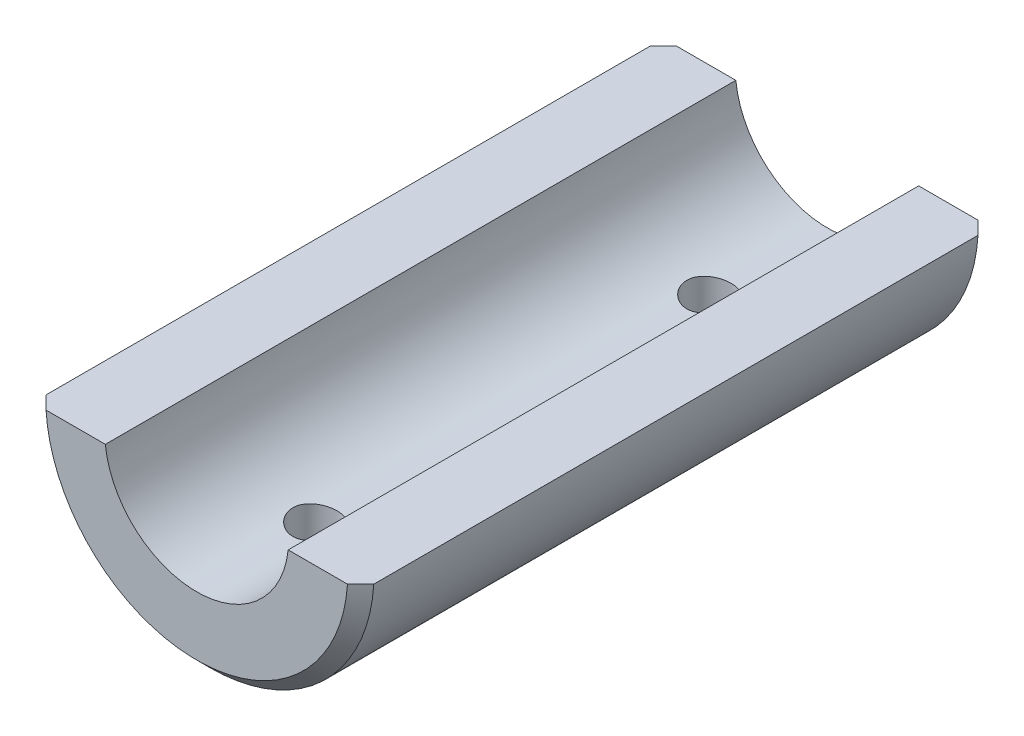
from build123d import *

# Parameters (mm, degrees)
EXTRUSION1_DEPTH        = 96
ESQUISSE5_R             = 3.375
ENL_V_MAT_EXTRU_1_DEPTH = 102.936254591
CHANFREIN1_SIZE         = 2


with BuildPart() as part:
    # Esquisse1 → Extrusion1 (new body)
    with BuildSketch(Plane.XY):
        with BuildLine():
            Line((-24.954959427, -1.5), (-13.919410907, -1.5))
            ThreePointArc((-13.919410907, -1.5), (0, -14), (13.919410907, -1.5))
            Line((13.919410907, -1.5), (24.954959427, -1.5))
            ThreePointArc((24.954959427, -1.5), (0, -25), (-24.954959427, -1.5))
        make_face()
    extrude(amount=EXTRUSION1_DEPTH)

    # Esquisse5 → Enl_v. mat.-Extru.1 (cut, through all)
    with BuildSketch(Plane(origin=(0, -1.5, 0), x_dir=(-1, 0, 0), z_dir=(0, 1, 0))):
        with Locations(Location((0, 78, 0), (0, 0, 90))):
            Circle(ESQUISSE5_R)
        with Locations(Location((0, 18, 0), (0, 0, 90))):
            Circle(ESQUISSE5_R)
    extrude(amount=-ENL_V_MAT_EXTRU_1_DEPTH, mode=Mode.SUBTRACT)

    # Chanfrein1
    chanfrein1_edges = [part.edges().sort_by_distance(p)[0] for p in [
        (0, -25, 0),
        (0, -25, 96),
    ]]
    chamfer(chanfrein1_edges, length=CHANFREIN1_SIZE)


solid = part.part
